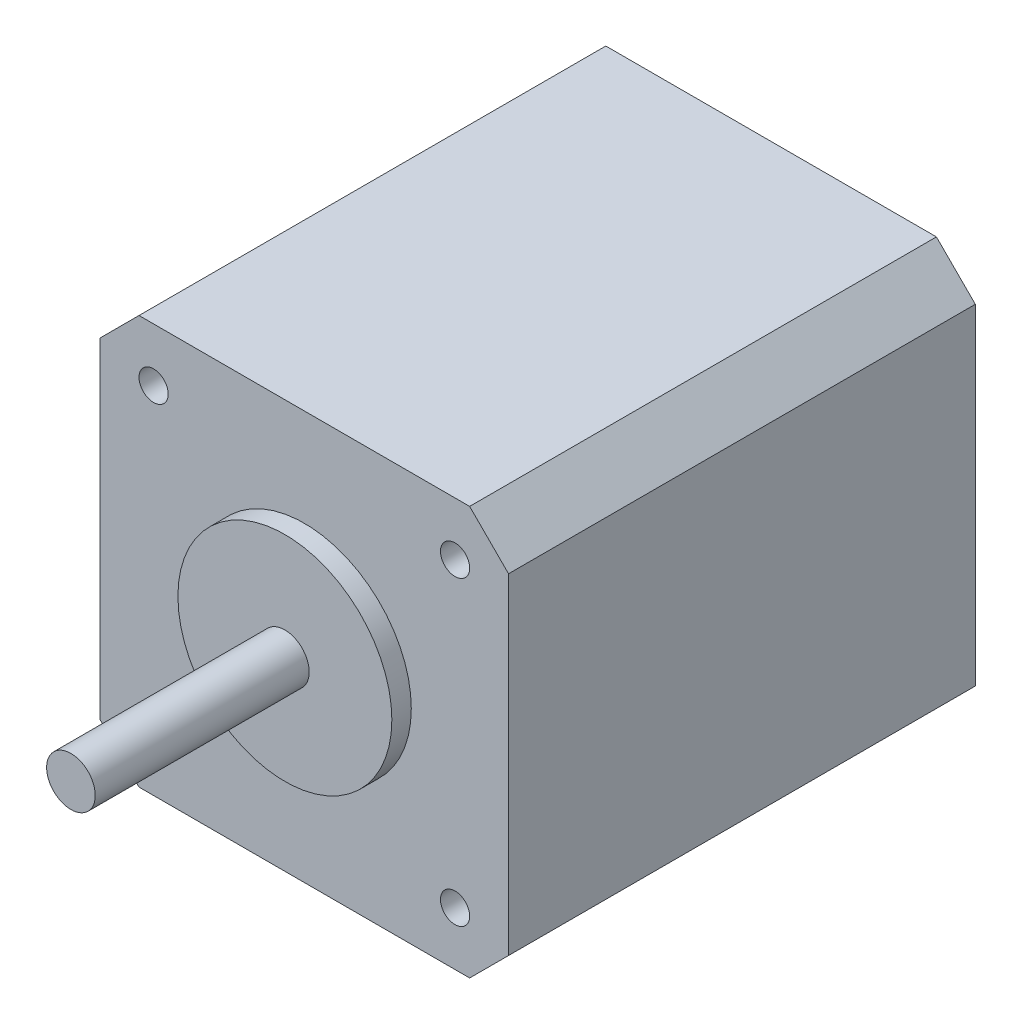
from build123d import *

# Parameters (mm, degrees)
EXTRUDE_1_DEPTH     = 48
SKETCH_2_R          = 11
EXTRUDE_2_DEPTH     = 2
SKETCH_3_R          = 2.5
EXTRUDE_3_DEPTH     = 22
SKETCH_4_R          = 1.5
CUT_EXTRUDE_1_DEPTH = 4.5


with BuildPart() as part:
    # Sketch 1 → Extrude 1 (new body)
    with BuildSketch(Plane.XY):
        Polygon((0, 38), (4, 42), (38, 42), (42, 38), (42, 4), (38, 0), (4, 0), (0, 4), align=None)
    extrude(amount=EXTRUDE_1_DEPTH)

    # Sketch 2 → Extrude 2 (add)
    with BuildSketch(Plane.XY.offset(48)):
        with Locations(Location((21, 21, 0), (0, 0, 180))):
            Circle(SKETCH_2_R)
    extrude(amount=EXTRUDE_2_DEPTH)

    # Sketch 3 → Extrude 3 (add)
    with BuildSketch(Plane.XY.offset(50)):
        with Locations((21, 21)):
            Circle(SKETCH_3_R)
    extrude(amount=EXTRUDE_3_DEPTH)

    # Sketch 4 → Cut-Extrude 1 (cut)
    with BuildSketch(Plane.XY.offset(48)):
        with Locations((5.5, 36.5)):
            Circle(SKETCH_4_R)
        with Locations((36.5, 36.5)):
            Circle(SKETCH_4_R)
        with Locations((5.5, 5.5)):
            Circle(SKETCH_4_R)
        with Locations((36.5, 5.5)):
            Circle(SKETCH_4_R)
    extrude(amount=-CUT_EXTRUDE_1_DEPTH, mode=Mode.SUBTRACT)


solid = part.part
